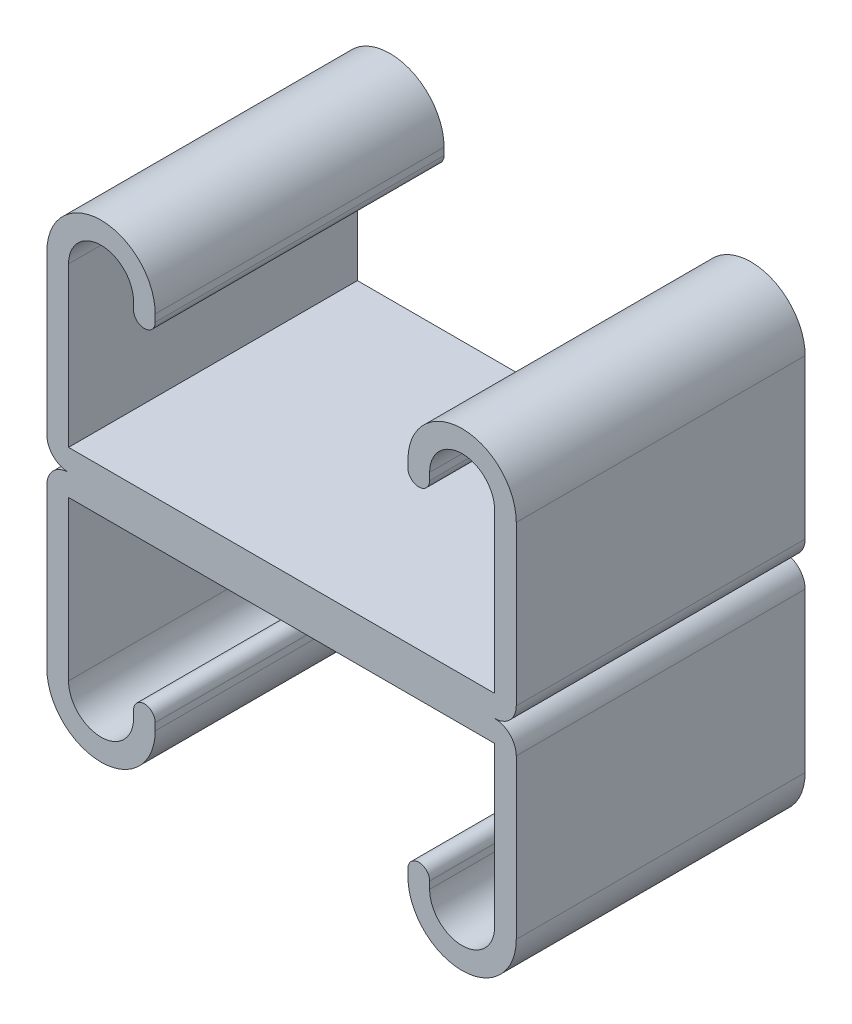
ISO-10303-21;
HEADER;
FILE_DESCRIPTION(('STEP AP214'),'2;1');
FILE_NAME('part.step','',(''),(''),'','','');
FILE_SCHEMA(('AUTOMOTIVE_DESIGN { 1 0 10303 214 1 1 1 1 }'));
ENDSEC;
DATA;
#1=APPLICATION_CONTEXT('core data for automotive mechanical design processes');
#2=APPLICATION_PROTOCOL_DEFINITION('international standard','automotive_design',2000,#1);
#3=PRODUCT_CONTEXT('',#1,'mechanical');
#4=PRODUCT('Part','Part','',(#3));
#5=PRODUCT_RELATED_PRODUCT_CATEGORY('part','',(#4));
#6=PRODUCT_DEFINITION_FORMATION('','',#4);
#7=PRODUCT_DEFINITION_CONTEXT('part definition',#1,'design');
#8=PRODUCT_DEFINITION('design','',#6,#7);
#9=PRODUCT_DEFINITION_SHAPE('','',#8);
#10=(LENGTH_UNIT() NAMED_UNIT(*) SI_UNIT(.MILLI.,.METRE.));
#11=(NAMED_UNIT(*) PLANE_ANGLE_UNIT() SI_UNIT($,.RADIAN.));
#12=(NAMED_UNIT(*) SI_UNIT($,.STERADIAN.) SOLID_ANGLE_UNIT());
#13=UNCERTAINTY_MEASURE_WITH_UNIT(LENGTH_MEASURE(1.E-05),#10,'distance_accuracy_value','');
#14=(GEOMETRIC_REPRESENTATION_CONTEXT(3) GLOBAL_UNCERTAINTY_ASSIGNED_CONTEXT((#13)) GLOBAL_UNIT_ASSIGNED_CONTEXT((#10,
#11,#12)) REPRESENTATION_CONTEXT('',''));
#15=CARTESIAN_POINT('',(0.,0.,0.));
#16=DIRECTION('',(0.,0.,1.));
#17=DIRECTION('',(1.,0.,0.));
#18=AXIS2_PLACEMENT_3D('',#15,#16,#17);
#19=CARTESIAN_POINT('',(-15.875,15.875,12.7));
#20=DIRECTION('',(0.,0.,-1.));
#21=DIRECTION('',(-1.,0.,0.));
#22=AXIS2_PLACEMENT_3D('',#19,#20,#21);
#23=CYLINDRICAL_SURFACE('',#22,4.7625);
#24=CARTESIAN_POINT('',(-15.875,15.875,-12.7));
#25=DIRECTION('',(0.,0.,1.));
#26=DIRECTION('',(-1.,0.,0.));
#27=AXIS2_PLACEMENT_3D('',#24,#25,#26);
#28=CIRCLE('',#27,4.7625);
#29=CARTESIAN_POINT('',(-11.1125,15.875,-12.7));
#30=VERTEX_POINT('',#29);
#31=CARTESIAN_POINT('',(-20.6375,15.875,-12.7));
#32=VERTEX_POINT('',#31);
#33=EDGE_CURVE('E207',#30,#32,#28,.T.);
#34=ORIENTED_EDGE('',*,*,#33,.T.);
#35=DIRECTION('',(0.,0.,-1.));
#36=VECTOR('',#35,1.);
#37=CARTESIAN_POINT('',(-20.6375,15.875,12.7));
#38=LINE('',#37,#36);
#39=CARTESIAN_POINT('',(-20.6375,15.875,12.7));
#40=VERTEX_POINT('',#39);
#41=EDGE_CURVE('E11',#40,#32,#38,.T.);
#42=ORIENTED_EDGE('',*,*,#41,.F.);
#43=CARTESIAN_POINT('',(-15.875,15.875,12.7));
#44=DIRECTION('',(0.,0.,1.));
#45=DIRECTION('',(-1.,0.,0.));
#46=AXIS2_PLACEMENT_3D('',#43,#44,#45);
#47=CIRCLE('',#46,4.7625);
#48=CARTESIAN_POINT('',(-11.1125,15.875,12.7));
#49=VERTEX_POINT('',#48);
#50=EDGE_CURVE('E253',#49,#40,#47,.T.);
#51=ORIENTED_EDGE('',*,*,#50,.F.);
#52=DIRECTION('',(0.,0.,-1.));
#53=VECTOR('',#52,1.);
#54=CARTESIAN_POINT('',(-11.1125,15.875,12.7));
#55=LINE('',#54,#53);
#56=EDGE_CURVE('E205',#49,#30,#55,.T.);
#57=ORIENTED_EDGE('',*,*,#56,.T.);
#58=EDGE_LOOP('',(#34,#42,#51,#57));
#59=FACE_BOUND('',#58,.T.);
#60=ADVANCED_FACE('F41',(#59),#23,.T.);
#61=CARTESIAN_POINT('',(-20.6375,15.875,12.7));
#62=DIRECTION('',(1.,0.,0.));
#63=DIRECTION('',(0.,1.,0.));
#64=AXIS2_PLACEMENT_3D('',#61,#62,#63);
#65=PLANE('',#64);
#66=DIRECTION('',(0.,-1.,0.));
#67=VECTOR('',#66,1.);
#68=CARTESIAN_POINT('',(-20.6375,15.875,-12.7));
#69=LINE('',#68,#67);
#70=CARTESIAN_POINT('',(-20.6375,1.905,-12.7));
#71=VERTEX_POINT('',#70);
#72=EDGE_CURVE('E208',#32,#71,#69,.T.);
#73=ORIENTED_EDGE('',*,*,#72,.T.);
#74=DIRECTION('',(0.,0.,-1.));
#75=VECTOR('',#74,1.);
#76=CARTESIAN_POINT('',(-20.6375,1.905,12.7));
#77=LINE('',#76,#75);
#78=CARTESIAN_POINT('',(-20.6375,1.905,12.7));
#79=VERTEX_POINT('',#78);
#80=EDGE_CURVE('E49',#79,#71,#77,.T.);
#81=ORIENTED_EDGE('',*,*,#80,.F.);
#82=DIRECTION('',(0.,-1.,0.));
#83=VECTOR('',#82,1.);
#84=CARTESIAN_POINT('',(-20.6375,15.875,12.7));
#85=LINE('',#84,#83);
#86=EDGE_CURVE('E128',#40,#79,#85,.T.);
#87=ORIENTED_EDGE('',*,*,#86,.F.);
#88=ORIENTED_EDGE('',*,*,#41,.T.);
#89=EDGE_LOOP('',(#73,#81,#87,#88));
#90=FACE_BOUND('',#89,.T.);
#91=ADVANCED_FACE('F512',(#90),#65,.F.);
#92=CARTESIAN_POINT('',(-18.7325,1.905,12.7));
#93=DIRECTION('',(0.,0.,-1.));
#94=DIRECTION('',(-1.,0.,0.));
#95=AXIS2_PLACEMENT_3D('',#92,#93,#94);
#96=CYLINDRICAL_SURFACE('',#95,1.905);
#97=CARTESIAN_POINT('',(-18.7325,1.905,-12.7));
#98=DIRECTION('',(0.,0.,1.));
#99=DIRECTION('',(-1.,0.,0.));
#100=AXIS2_PLACEMENT_3D('',#97,#98,#99);
#101=CIRCLE('',#100,1.905);
#102=CARTESIAN_POINT('',(-18.7325,0.,-12.7));
#103=VERTEX_POINT('',#102);
#104=EDGE_CURVE('E213',#71,#103,#101,.T.);
#105=ORIENTED_EDGE('',*,*,#104,.T.);
#106=DIRECTION('',(0.,0.,-1.));
#107=VECTOR('',#106,1.);
#108=CARTESIAN_POINT('',(-18.7325,0.,12.7));
#109=LINE('',#108,#107);
#110=CARTESIAN_POINT('',(-18.7325,0.,12.7));
#111=VERTEX_POINT('',#110);
#112=EDGE_CURVE('E304',#111,#103,#109,.T.);
#113=ORIENTED_EDGE('',*,*,#112,.F.);
#114=CARTESIAN_POINT('',(-18.7325,1.905,12.7));
#115=DIRECTION('',(0.,0.,1.));
#116=DIRECTION('',(-1.,0.,0.));
#117=AXIS2_PLACEMENT_3D('',#114,#115,#116);
#118=CIRCLE('',#117,1.905);
#119=EDGE_CURVE('E320',#79,#111,#118,.T.);
#120=ORIENTED_EDGE('',*,*,#119,.F.);
#121=ORIENTED_EDGE('',*,*,#80,.T.);
#122=EDGE_LOOP('',(#105,#113,#120,#121));
#123=FACE_BOUND('',#122,.T.);
#124=ADVANCED_FACE('F314',(#123),#96,.T.);
#125=CARTESIAN_POINT('',(18.7325,1.90500000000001,12.7));
#126=DIRECTION('',(0.,0.,-1.));
#127=DIRECTION('',(-1.,0.,0.));
#128=AXIS2_PLACEMENT_3D('',#125,#126,#127);
#129=CYLINDRICAL_SURFACE('',#128,1.905);
#130=CARTESIAN_POINT('',(18.7325,1.90500000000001,-12.7));
#131=DIRECTION('',(0.,0.,1.));
#132=DIRECTION('',(1.,0.,0.));
#133=AXIS2_PLACEMENT_3D('',#130,#131,#132);
#134=CIRCLE('',#133,1.905);
#135=CARTESIAN_POINT('',(18.7325,0.,-12.7));
#136=VERTEX_POINT('',#135);
#137=CARTESIAN_POINT('',(20.6375,1.90500000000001,-12.7));
#138=VERTEX_POINT('',#137);
#139=EDGE_CURVE('E220',#136,#138,#134,.T.);
#140=ORIENTED_EDGE('',*,*,#139,.T.);
#141=DIRECTION('',(0.,0.,-1.));
#142=VECTOR('',#141,1.);
#143=CARTESIAN_POINT('',(20.6375,1.90500000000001,12.7));
#144=LINE('',#143,#142);
#145=CARTESIAN_POINT('',(20.6375,1.90500000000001,12.7));
#146=VERTEX_POINT('',#145);
#147=EDGE_CURVE('E300',#146,#138,#144,.T.);
#148=ORIENTED_EDGE('',*,*,#147,.F.);
#149=CARTESIAN_POINT('',(18.7325,1.90500000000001,12.7));
#150=DIRECTION('',(0.,0.,1.));
#151=DIRECTION('',(1.,0.,0.));
#152=AXIS2_PLACEMENT_3D('',#149,#150,#151);
#153=CIRCLE('',#152,1.905);
#154=CARTESIAN_POINT('',(18.7325,0.,12.7));
#155=VERTEX_POINT('',#154);
#156=EDGE_CURVE('E413',#155,#146,#153,.T.);
#157=ORIENTED_EDGE('',*,*,#156,.F.);
#158=DIRECTION('',(0.,0.,-1.));
#159=VECTOR('',#158,1.);
#160=CARTESIAN_POINT('',(18.7325,0.,12.7));
#161=LINE('',#160,#159);
#162=EDGE_CURVE('E301',#155,#136,#161,.T.);
#163=ORIENTED_EDGE('',*,*,#162,.T.);
#164=EDGE_LOOP('',(#140,#148,#157,#163));
#165=FACE_BOUND('',#164,.T.);
#166=ADVANCED_FACE('F520',(#165),#129,.T.);
#167=CARTESIAN_POINT('',(20.6375,1.90500000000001,12.7));
#168=DIRECTION('',(-1.,0.,0.));
#169=DIRECTION('',(0.,0.,1.));
#170=AXIS2_PLACEMENT_3D('',#167,#168,#169);
#171=PLANE('',#170);
#172=DIRECTION('',(0.,1.,0.));
#173=VECTOR('',#172,1.);
#174=CARTESIAN_POINT('',(20.6375,1.90500000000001,-12.7));
#175=LINE('',#174,#173);
#176=CARTESIAN_POINT('',(20.6375,15.875,-12.7));
#177=VERTEX_POINT('',#176);
#178=EDGE_CURVE('E216',#138,#177,#175,.T.);
#179=ORIENTED_EDGE('',*,*,#178,.T.);
#180=DIRECTION('',(0.,0.,-1.));
#181=VECTOR('',#180,1.);
#182=CARTESIAN_POINT('',(20.6375,15.875,12.7));
#183=LINE('',#182,#181);
#184=CARTESIAN_POINT('',(20.6375,15.875,12.7));
#185=VERTEX_POINT('',#184);
#186=EDGE_CURVE('E291',#185,#177,#183,.T.);
#187=ORIENTED_EDGE('',*,*,#186,.F.);
#188=DIRECTION('',(0.,1.,0.));
#189=VECTOR('',#188,1.);
#190=CARTESIAN_POINT('',(20.6375,1.90500000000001,12.7));
#191=LINE('',#190,#189);
#192=EDGE_CURVE('E417',#146,#185,#191,.T.);
#193=ORIENTED_EDGE('',*,*,#192,.F.);
#194=ORIENTED_EDGE('',*,*,#147,.T.);
#195=EDGE_LOOP('',(#179,#187,#193,#194));
#196=FACE_BOUND('',#195,.T.);
#197=ADVANCED_FACE('F523',(#196),#171,.F.);
#198=CARTESIAN_POINT('',(15.875,15.875,12.7));
#199=DIRECTION('',(0.,0.,-1.));
#200=DIRECTION('',(-1.,0.,0.));
#201=AXIS2_PLACEMENT_3D('',#198,#199,#200);
#202=CYLINDRICAL_SURFACE('',#201,4.7625);
#203=CARTESIAN_POINT('',(15.875,15.875,-12.7));
#204=DIRECTION('',(0.,0.,1.));
#205=DIRECTION('',(1.,0.,0.));
#206=AXIS2_PLACEMENT_3D('',#203,#204,#205);
#207=CIRCLE('',#206,4.7625);
#208=CARTESIAN_POINT('',(11.1125,15.875,-12.7));
#209=VERTEX_POINT('',#208);
#210=EDGE_CURVE('E224',#177,#209,#207,.T.);
#211=ORIENTED_EDGE('',*,*,#210,.T.);
#212=DIRECTION('',(0.,0.,-1.));
#213=VECTOR('',#212,1.);
#214=CARTESIAN_POINT('',(11.1125,15.875,12.7));
#215=LINE('',#214,#213);
#216=CARTESIAN_POINT('',(11.1125,15.875,12.7));
#217=VERTEX_POINT('',#216);
#218=EDGE_CURVE('E286',#217,#209,#215,.T.);
#219=ORIENTED_EDGE('',*,*,#218,.F.);
#220=CARTESIAN_POINT('',(15.875,15.875,12.7));
#221=DIRECTION('',(0.,0.,1.));
#222=DIRECTION('',(1.,0.,0.));
#223=AXIS2_PLACEMENT_3D('',#220,#221,#222);
#224=CIRCLE('',#223,4.7625);
#225=EDGE_CURVE('E416',#185,#217,#224,.T.);
#226=ORIENTED_EDGE('',*,*,#225,.F.);
#227=ORIENTED_EDGE('',*,*,#186,.T.);
#228=EDGE_LOOP('',(#211,#219,#226,#227));
#229=FACE_BOUND('',#228,.T.);
#230=ADVANCED_FACE('F527',(#229),#202,.T.);
#231=CARTESIAN_POINT('',(11.1125,15.875,12.7));
#232=DIRECTION('',(1.,0.,0.));
#233=DIRECTION('',(0.,1.,0.));
#234=AXIS2_PLACEMENT_3D('',#231,#232,#233);
#235=PLANE('',#234);
#236=DIRECTION('',(0.,-1.,0.));
#237=VECTOR('',#236,1.);
#238=CARTESIAN_POINT('',(11.1125,15.875,-12.7));
#239=LINE('',#238,#237);
#240=CARTESIAN_POINT('',(11.1125,15.24,-12.7));
#241=VERTEX_POINT('',#240);
#242=EDGE_CURVE('E228',#209,#241,#239,.T.);
#243=ORIENTED_EDGE('',*,*,#242,.T.);
#244=DIRECTION('',(0.,0.,-1.));
#245=VECTOR('',#244,1.);
#246=CARTESIAN_POINT('',(11.1125,15.24,12.7));
#247=LINE('',#246,#245);
#248=CARTESIAN_POINT('',(11.1125,15.24,12.7));
#249=VERTEX_POINT('',#248);
#250=EDGE_CURVE('E281',#249,#241,#247,.T.);
#251=ORIENTED_EDGE('',*,*,#250,.F.);
#252=DIRECTION('',(0.,-1.,0.));
#253=VECTOR('',#252,1.);
#254=CARTESIAN_POINT('',(11.1125,15.875,12.7));
#255=LINE('',#254,#253);
#256=EDGE_CURVE('E422',#217,#249,#255,.T.);
#257=ORIENTED_EDGE('',*,*,#256,.F.);
#258=ORIENTED_EDGE('',*,*,#218,.T.);
#259=EDGE_LOOP('',(#243,#251,#257,#258));
#260=FACE_BOUND('',#259,.T.);
#261=ADVANCED_FACE('F528',(#260),#235,.F.);
#262=CARTESIAN_POINT('',(12.065,15.24,12.7));
#263=DIRECTION('',(0.,0.,-1.));
#264=DIRECTION('',(-1.,0.,0.));
#265=AXIS2_PLACEMENT_3D('',#262,#263,#264);
#266=CYLINDRICAL_SURFACE('',#265,0.952500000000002);
#267=CARTESIAN_POINT('',(12.065,15.24,-12.7));
#268=DIRECTION('',(0.,0.,1.));
#269=DIRECTION('',(1.,0.,0.));
#270=AXIS2_PLACEMENT_3D('',#267,#268,#269);
#271=CIRCLE('',#270,0.952500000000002);
#272=CARTESIAN_POINT('',(13.0175,15.24,-12.7));
#273=VERTEX_POINT('',#272);
#274=EDGE_CURVE('E230',#241,#273,#271,.T.);
#275=ORIENTED_EDGE('',*,*,#274,.T.);
#276=DIRECTION('',(0.,0.,-1.));
#277=VECTOR('',#276,1.);
#278=CARTESIAN_POINT('',(13.0175,15.24,12.7));
#279=LINE('',#278,#277);
#280=CARTESIAN_POINT('',(13.0175,15.24,12.7));
#281=VERTEX_POINT('',#280);
#282=EDGE_CURVE('E282',#281,#273,#279,.T.);
#283=ORIENTED_EDGE('',*,*,#282,.F.);
#284=CARTESIAN_POINT('',(12.065,15.24,12.7));
#285=DIRECTION('',(0.,0.,1.));
#286=DIRECTION('',(1.,0.,0.));
#287=AXIS2_PLACEMENT_3D('',#284,#285,#286);
#288=CIRCLE('',#287,0.952500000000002);
#289=EDGE_CURVE('E424',#249,#281,#288,.T.);
#290=ORIENTED_EDGE('',*,*,#289,.F.);
#291=ORIENTED_EDGE('',*,*,#250,.T.);
#292=EDGE_LOOP('',(#275,#283,#290,#291));
#293=FACE_BOUND('',#292,.T.);
#294=ADVANCED_FACE('F534',(#293),#266,.T.);
#295=CARTESIAN_POINT('',(13.0175,15.875,12.7));
#296=DIRECTION('',(-1.,0.,0.));
#297=DIRECTION('',(0.,-1.,0.));
#298=AXIS2_PLACEMENT_3D('',#295,#296,#297);
#299=PLANE('',#298);
#300=DIRECTION('',(0.,1.,0.));
#301=VECTOR('',#300,1.);
#302=CARTESIAN_POINT('',(13.0175,15.875,-12.7));
#303=LINE('',#302,#301);
#304=CARTESIAN_POINT('',(13.0175,15.875,-12.7));
#305=VERTEX_POINT('',#304);
#306=EDGE_CURVE('E235',#273,#305,#303,.T.);
#307=ORIENTED_EDGE('',*,*,#306,.T.);
#308=DIRECTION('',(0.,0.,-1.));
#309=VECTOR('',#308,1.);
#310=CARTESIAN_POINT('',(13.0175,15.875,12.7));
#311=LINE('',#310,#309);
#312=CARTESIAN_POINT('',(13.0175,15.875,12.7));
#313=VERTEX_POINT('',#312);
#314=EDGE_CURVE('E276',#313,#305,#311,.T.);
#315=ORIENTED_EDGE('',*,*,#314,.F.);
#316=DIRECTION('',(0.,1.,0.));
#317=VECTOR('',#316,1.);
#318=CARTESIAN_POINT('',(13.0175,15.875,12.7));
#319=LINE('',#318,#317);
#320=EDGE_CURVE('E426',#281,#313,#319,.T.);
#321=ORIENTED_EDGE('',*,*,#320,.F.);
#322=ORIENTED_EDGE('',*,*,#282,.T.);
#323=EDGE_LOOP('',(#307,#315,#321,#322));
#324=FACE_BOUND('',#323,.T.);
#325=ADVANCED_FACE('F540',(#324),#299,.F.);
#326=CARTESIAN_POINT('',(15.875,15.875,12.7));
#327=DIRECTION('',(0.,0.,-1.));
#328=DIRECTION('',(-1.,0.,0.));
#329=AXIS2_PLACEMENT_3D('',#326,#327,#328);
#330=CYLINDRICAL_SURFACE('',#329,2.8575);
#331=CARTESIAN_POINT('',(15.875,15.875,-12.7));
#332=DIRECTION('',(0.,0.,-1.));
#333=DIRECTION('',(1.,0.,0.));
#334=AXIS2_PLACEMENT_3D('',#331,#332,#333);
#335=CIRCLE('',#334,2.8575);
#336=CARTESIAN_POINT('',(18.7325,15.875,-12.7));
#337=VERTEX_POINT('',#336);
#338=EDGE_CURVE('E232',#305,#337,#335,.T.);
#339=ORIENTED_EDGE('',*,*,#338,.T.);
#340=DIRECTION('',(0.,0.,-1.));
#341=VECTOR('',#340,1.);
#342=CARTESIAN_POINT('',(18.7325,15.875,12.7));
#343=LINE('',#342,#341);
#344=CARTESIAN_POINT('',(18.7325,15.875,12.7));
#345=VERTEX_POINT('',#344);
#346=EDGE_CURVE('E271',#345,#337,#343,.T.);
#347=ORIENTED_EDGE('',*,*,#346,.F.);
#348=CARTESIAN_POINT('',(15.875,15.875,12.7));
#349=DIRECTION('',(0.,0.,-1.));
#350=DIRECTION('',(1.,0.,0.));
#351=AXIS2_PLACEMENT_3D('',#348,#349,#350);
#352=CIRCLE('',#351,2.8575);
#353=EDGE_CURVE('E431',#313,#345,#352,.T.);
#354=ORIENTED_EDGE('',*,*,#353,.F.);
#355=ORIENTED_EDGE('',*,*,#314,.T.);
#356=EDGE_LOOP('',(#339,#347,#354,#355));
#357=FACE_BOUND('',#356,.T.);
#358=ADVANCED_FACE('F545',(#357),#330,.F.);
#359=CARTESIAN_POINT('',(18.7325,1.905,12.7));
#360=DIRECTION('',(1.,0.,0.));
#361=DIRECTION('',(0.,1.,0.));
#362=AXIS2_PLACEMENT_3D('',#359,#360,#361);
#363=PLANE('',#362);
#364=DIRECTION('',(0.,-1.,0.));
#365=VECTOR('',#364,1.);
#366=CARTESIAN_POINT('',(18.7325,1.905,-12.7));
#367=LINE('',#366,#365);
#368=CARTESIAN_POINT('',(18.7325,1.905,-12.7));
#369=VERTEX_POINT('',#368);
#370=EDGE_CURVE('E238',#337,#369,#367,.T.);
#371=ORIENTED_EDGE('',*,*,#370,.T.);
#372=DIRECTION('',(0.,0.,-1.));
#373=VECTOR('',#372,1.);
#374=CARTESIAN_POINT('',(18.7325,1.905,12.7));
#375=LINE('',#374,#373);
#376=CARTESIAN_POINT('',(18.7325,1.905,12.7));
#377=VERTEX_POINT('',#376);
#378=EDGE_CURVE('E266',#377,#369,#375,.T.);
#379=ORIENTED_EDGE('',*,*,#378,.F.);
#380=DIRECTION('',(0.,-1.,0.));
#381=VECTOR('',#380,1.);
#382=CARTESIAN_POINT('',(18.7325,1.905,12.7));
#383=LINE('',#382,#381);
#384=EDGE_CURVE('E432',#345,#377,#383,.T.);
#385=ORIENTED_EDGE('',*,*,#384,.F.);
#386=ORIENTED_EDGE('',*,*,#346,.T.);
#387=EDGE_LOOP('',(#371,#379,#385,#386));
#388=FACE_BOUND('',#387,.T.);
#389=ADVANCED_FACE('F547',(#388),#363,.F.);
#390=CARTESIAN_POINT('',(-18.7325,1.905,12.7));
#391=DIRECTION('',(0.,-1.,0.));
#392=DIRECTION('',(1.,0.,0.));
#393=AXIS2_PLACEMENT_3D('',#390,#391,#392);
#394=PLANE('',#393);
#395=DIRECTION('',(-1.,0.,0.));
#396=VECTOR('',#395,1.);
#397=CARTESIAN_POINT('',(-18.7325,1.905,-12.7));
#398=LINE('',#397,#396);
#399=CARTESIAN_POINT('',(-18.7325,1.905,-12.7));
#400=VERTEX_POINT('',#399);
#401=EDGE_CURVE('E241',#369,#400,#398,.T.);
#402=ORIENTED_EDGE('',*,*,#401,.T.);
#403=DIRECTION('',(0.,0.,-1.));
#404=VECTOR('',#403,1.);
#405=CARTESIAN_POINT('',(-18.7325,1.905,12.7));
#406=LINE('',#405,#404);
#407=CARTESIAN_POINT('',(-18.7325,1.905,12.7));
#408=VERTEX_POINT('',#407);
#409=EDGE_CURVE('E261',#408,#400,#406,.T.);
#410=ORIENTED_EDGE('',*,*,#409,.F.);
#411=DIRECTION('',(-1.,0.,0.));
#412=VECTOR('',#411,1.);
#413=CARTESIAN_POINT('',(-18.7325,1.905,12.7));
#414=LINE('',#413,#412);
#415=EDGE_CURVE('E440',#377,#408,#414,.T.);
#416=ORIENTED_EDGE('',*,*,#415,.F.);
#417=ORIENTED_EDGE('',*,*,#378,.T.);
#418=EDGE_LOOP('',(#402,#410,#416,#417));
#419=FACE_BOUND('',#418,.T.);
#420=ADVANCED_FACE('F548',(#419),#394,.F.);
#421=CARTESIAN_POINT('',(-18.7325,15.875,12.7));
#422=DIRECTION('',(-1.,0.,0.));
#423=DIRECTION('',(0.,-1.,0.));
#424=AXIS2_PLACEMENT_3D('',#421,#422,#423);
#425=PLANE('',#424);
#426=DIRECTION('',(0.,1.,0.));
#427=VECTOR('',#426,1.);
#428=CARTESIAN_POINT('',(-18.7325,15.875,-12.7));
#429=LINE('',#428,#427);
#430=CARTESIAN_POINT('',(-18.7325,15.875,-12.7));
#431=VERTEX_POINT('',#430);
#432=EDGE_CURVE('E242',#400,#431,#429,.T.);
#433=ORIENTED_EDGE('',*,*,#432,.T.);
#434=DIRECTION('',(0.,0.,-1.));
#435=VECTOR('',#434,1.);
#436=CARTESIAN_POINT('',(-18.7325,15.875,12.7));
#437=LINE('',#436,#435);
#438=CARTESIAN_POINT('',(-18.7325,15.875,12.7));
#439=VERTEX_POINT('',#438);
#440=EDGE_CURVE('E262',#439,#431,#437,.T.);
#441=ORIENTED_EDGE('',*,*,#440,.F.);
#442=DIRECTION('',(0.,1.,0.));
#443=VECTOR('',#442,1.);
#444=CARTESIAN_POINT('',(-18.7325,15.875,12.7));
#445=LINE('',#444,#443);
#446=EDGE_CURVE('E439',#408,#439,#445,.T.);
#447=ORIENTED_EDGE('',*,*,#446,.F.);
#448=ORIENTED_EDGE('',*,*,#409,.T.);
#449=EDGE_LOOP('',(#433,#441,#447,#448));
#450=FACE_BOUND('',#449,.T.);
#451=ADVANCED_FACE('F493',(#450),#425,.F.);
#452=CARTESIAN_POINT('',(-15.875,15.875,12.7));
#453=DIRECTION('',(0.,0.,-1.));
#454=DIRECTION('',(-1.,0.,0.));
#455=AXIS2_PLACEMENT_3D('',#452,#453,#454);
#456=CYLINDRICAL_SURFACE('',#455,2.8575);
#457=CARTESIAN_POINT('',(-15.875,15.875,-12.7));
#458=DIRECTION('',(0.,0.,-1.));
#459=DIRECTION('',(-1.,0.,0.));
#460=AXIS2_PLACEMENT_3D('',#457,#458,#459);
#461=CIRCLE('',#460,2.8575);
#462=CARTESIAN_POINT('',(-13.0175,15.875,-12.7));
#463=VERTEX_POINT('',#462);
#464=EDGE_CURVE('E250',#431,#463,#461,.T.);
#465=ORIENTED_EDGE('',*,*,#464,.T.);
#466=DIRECTION('',(0.,0.,-1.));
#467=VECTOR('',#466,1.);
#468=CARTESIAN_POINT('',(-13.0175,15.875,12.7));
#469=LINE('',#468,#467);
#470=CARTESIAN_POINT('',(-13.0175,15.875,12.7));
#471=VERTEX_POINT('',#470);
#472=EDGE_CURVE('E191',#471,#463,#469,.T.);
#473=ORIENTED_EDGE('',*,*,#472,.F.);
#474=CARTESIAN_POINT('',(-15.875,15.875,12.7));
#475=DIRECTION('',(0.,0.,-1.));
#476=DIRECTION('',(-1.,0.,0.));
#477=AXIS2_PLACEMENT_3D('',#474,#475,#476);
#478=CIRCLE('',#477,2.8575);
#479=EDGE_CURVE('E181',#439,#471,#478,.T.);
#480=ORIENTED_EDGE('',*,*,#479,.F.);
#481=ORIENTED_EDGE('',*,*,#440,.T.);
#482=EDGE_LOOP('',(#465,#473,#480,#481));
#483=FACE_BOUND('',#482,.T.);
#484=ADVANCED_FACE('F492',(#483),#456,.F.);
#485=CARTESIAN_POINT('',(-13.0175,15.875,12.7));
#486=DIRECTION('',(1.,0.,0.));
#487=DIRECTION('',(0.,1.,0.));
#488=AXIS2_PLACEMENT_3D('',#485,#486,#487);
#489=PLANE('',#488);
#490=DIRECTION('',(0.,-1.,0.));
#491=VECTOR('',#490,1.);
#492=CARTESIAN_POINT('',(-13.0175,15.875,-12.7));
#493=LINE('',#492,#491);
#494=CARTESIAN_POINT('',(-13.0175,15.24,-12.7));
#495=VERTEX_POINT('',#494);
#496=EDGE_CURVE('E188',#463,#495,#493,.T.);
#497=ORIENTED_EDGE('',*,*,#496,.T.);
#498=DIRECTION('',(0.,0.,-1.));
#499=VECTOR('',#498,1.);
#500=CARTESIAN_POINT('',(-13.0175,15.24,12.7));
#501=LINE('',#500,#499);
#502=CARTESIAN_POINT('',(-13.0175,15.24,12.7));
#503=VERTEX_POINT('',#502);
#504=EDGE_CURVE('E190',#503,#495,#501,.T.);
#505=ORIENTED_EDGE('',*,*,#504,.F.);
#506=DIRECTION('',(0.,-1.,0.));
#507=VECTOR('',#506,1.);
#508=CARTESIAN_POINT('',(-13.0175,15.875,12.7));
#509=LINE('',#508,#507);
#510=EDGE_CURVE('E174',#471,#503,#509,.T.);
#511=ORIENTED_EDGE('',*,*,#510,.F.);
#512=ORIENTED_EDGE('',*,*,#472,.T.);
#513=EDGE_LOOP('',(#497,#505,#511,#512));
#514=FACE_BOUND('',#513,.T.);
#515=ADVANCED_FACE('F189',(#514),#489,.F.);
#516=CARTESIAN_POINT('',(-12.065,15.24,12.7));
#517=DIRECTION('',(0.,0.,-1.));
#518=DIRECTION('',(-1.,0.,0.));
#519=AXIS2_PLACEMENT_3D('',#516,#517,#518);
#520=CYLINDRICAL_SURFACE('',#519,0.952500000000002);
#521=CARTESIAN_POINT('',(-12.065,15.24,-12.7));
#522=DIRECTION('',(0.,0.,1.));
#523=DIRECTION('',(-1.,0.,0.));
#524=AXIS2_PLACEMENT_3D('',#521,#522,#523);
#525=CIRCLE('',#524,0.952500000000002);
#526=CARTESIAN_POINT('',(-11.1125,15.24,-12.7));
#527=VERTEX_POINT('',#526);
#528=EDGE_CURVE('E114',#495,#527,#525,.T.);
#529=ORIENTED_EDGE('',*,*,#528,.T.);
#530=DIRECTION('',(0.,0.,-1.));
#531=VECTOR('',#530,1.);
#532=CARTESIAN_POINT('',(-11.1125,15.24,12.7));
#533=LINE('',#532,#531);
#534=CARTESIAN_POINT('',(-11.1125,15.24,12.7));
#535=VERTEX_POINT('',#534);
#536=EDGE_CURVE('E195',#535,#527,#533,.T.);
#537=ORIENTED_EDGE('',*,*,#536,.F.);
#538=CARTESIAN_POINT('',(-12.065,15.24,12.7));
#539=DIRECTION('',(0.,0.,1.));
#540=DIRECTION('',(-1.,0.,0.));
#541=AXIS2_PLACEMENT_3D('',#538,#539,#540);
#542=CIRCLE('',#541,0.952500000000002);
#543=EDGE_CURVE('E177',#503,#535,#542,.T.);
#544=ORIENTED_EDGE('',*,*,#543,.F.);
#545=ORIENTED_EDGE('',*,*,#504,.T.);
#546=EDGE_LOOP('',(#529,#537,#544,#545));
#547=FACE_BOUND('',#546,.T.);
#548=ADVANCED_FACE('F192',(#547),#520,.T.);
#549=CARTESIAN_POINT('',(-11.1125,15.875,12.7));
#550=DIRECTION('',(-1.,0.,0.));
#551=DIRECTION('',(0.,-1.,0.));
#552=AXIS2_PLACEMENT_3D('',#549,#550,#551);
#553=PLANE('',#552);
#554=DIRECTION('',(0.,1.,0.));
#555=VECTOR('',#554,1.);
#556=CARTESIAN_POINT('',(-11.1125,15.875,-12.7));
#557=LINE('',#556,#555);
#558=EDGE_CURVE('E122',#527,#30,#557,.T.);
#559=ORIENTED_EDGE('',*,*,#558,.T.);
#560=ORIENTED_EDGE('',*,*,#56,.F.);
#561=DIRECTION('',(0.,1.,0.));
#562=VECTOR('',#561,1.);
#563=CARTESIAN_POINT('',(-11.1125,15.875,12.7));
#564=LINE('',#563,#562);
#565=EDGE_CURVE('E59',#535,#49,#564,.T.);
#566=ORIENTED_EDGE('',*,*,#565,.F.);
#567=ORIENTED_EDGE('',*,*,#536,.T.);
#568=EDGE_LOOP('',(#559,#560,#566,#567));
#569=FACE_BOUND('',#568,.T.);
#570=ADVANCED_FACE('F497',(#569),#553,.F.);
#571=CARTESIAN_POINT('',(-15.875,15.875,12.7));
#572=DIRECTION('',(0.,0.,-1.));
#573=DIRECTION('',(-1.,0.,0.));
#574=AXIS2_PLACEMENT_3D('',#571,#572,#573);
#575=PLANE('',#574);
#576=ORIENTED_EDGE('',*,*,#50,.T.);
#577=ORIENTED_EDGE('',*,*,#86,.T.);
#578=ORIENTED_EDGE('',*,*,#119,.T.);
#579=CARTESIAN_POINT('',(-18.7325,-1.905,12.7));
#580=DIRECTION('',(0.,0.,-1.));
#581=DIRECTION('',(-1.,0.,0.));
#582=AXIS2_PLACEMENT_3D('',#579,#580,#581);
#583=CIRCLE('',#582,1.905);
#584=CARTESIAN_POINT('',(-20.6375,-1.905,12.7));
#585=VERTEX_POINT('',#584);
#586=EDGE_CURVE('E913',#585,#111,#583,.T.);
#587=ORIENTED_EDGE('',*,*,#586,.F.);
#588=DIRECTION('',(0.,1.,0.));
#589=VECTOR('',#588,1.);
#590=CARTESIAN_POINT('',(-20.6375,-15.875,12.7));
#591=LINE('',#590,#589);
#592=CARTESIAN_POINT('',(-20.6375,-15.875,12.7));
#593=VERTEX_POINT('',#592);
#594=EDGE_CURVE('E346',#593,#585,#591,.T.);
#595=ORIENTED_EDGE('',*,*,#594,.F.);
#596=CARTESIAN_POINT('',(-15.875,-15.875,12.7));
#597=DIRECTION('',(0.,0.,-1.));
#598=DIRECTION('',(-1.,0.,0.));
#599=AXIS2_PLACEMENT_3D('',#596,#597,#598);
#600=CIRCLE('',#599,4.7625);
#601=CARTESIAN_POINT('',(-11.1125,-15.875,12.7));
#602=VERTEX_POINT('',#601);
#603=EDGE_CURVE('E340',#602,#593,#600,.T.);
#604=ORIENTED_EDGE('',*,*,#603,.F.);
#605=DIRECTION('',(0.,-1.,0.));
#606=VECTOR('',#605,1.);
#607=CARTESIAN_POINT('',(-11.1125,-15.875,12.7));
#608=LINE('',#607,#606);
#609=CARTESIAN_POINT('',(-11.1125,-15.24,12.7));
#610=VERTEX_POINT('',#609);
#611=EDGE_CURVE('E850',#610,#602,#608,.T.);
#612=ORIENTED_EDGE('',*,*,#611,.F.);
#613=CARTESIAN_POINT('',(-12.065,-15.24,12.7));
#614=DIRECTION('',(0.,0.,-1.));
#615=DIRECTION('',(-1.,0.,0.));
#616=AXIS2_PLACEMENT_3D('',#613,#614,#615);
#617=CIRCLE('',#616,0.952500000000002);
#618=CARTESIAN_POINT('',(-13.0175,-15.24,12.7));
#619=VERTEX_POINT('',#618);
#620=EDGE_CURVE('E857',#619,#610,#617,.T.);
#621=ORIENTED_EDGE('',*,*,#620,.F.);
#622=DIRECTION('',(0.,1.,0.));
#623=VECTOR('',#622,1.);
#624=CARTESIAN_POINT('',(-13.0175,-15.875,12.7));
#625=LINE('',#624,#623);
#626=CARTESIAN_POINT('',(-13.0175,-15.875,12.7));
#627=VERTEX_POINT('',#626);
#628=EDGE_CURVE('E861',#627,#619,#625,.T.);
#629=ORIENTED_EDGE('',*,*,#628,.F.);
#630=CARTESIAN_POINT('',(-15.875,-15.875,12.7));
#631=DIRECTION('',(0.,0.,1.));
#632=DIRECTION('',(-1.,0.,0.));
#633=AXIS2_PLACEMENT_3D('',#630,#631,#632);
#634=CIRCLE('',#633,2.8575);
#635=CARTESIAN_POINT('',(-18.7325,-15.875,12.7));
#636=VERTEX_POINT('',#635);
#637=EDGE_CURVE('E867',#636,#627,#634,.T.);
#638=ORIENTED_EDGE('',*,*,#637,.F.);
#639=DIRECTION('',(0.,-1.,0.));
#640=VECTOR('',#639,1.);
#641=CARTESIAN_POINT('',(-18.7325,-15.875,12.7));
#642=LINE('',#641,#640);
#643=CARTESIAN_POINT('',(-18.7325,-1.905,12.7));
#644=VERTEX_POINT('',#643);
#645=EDGE_CURVE('E874',#644,#636,#642,.T.);
#646=ORIENTED_EDGE('',*,*,#645,.F.);
#647=DIRECTION('',(-1.,0.,0.));
#648=VECTOR('',#647,1.);
#649=CARTESIAN_POINT('',(-18.7325,-1.905,12.7));
#650=LINE('',#649,#648);
#651=CARTESIAN_POINT('',(18.7325,-1.905,12.7));
#652=VERTEX_POINT('',#651);
#653=EDGE_CURVE('E877',#652,#644,#650,.T.);
#654=ORIENTED_EDGE('',*,*,#653,.F.);
#655=DIRECTION('',(0.,1.,0.));
#656=VECTOR('',#655,1.);
#657=CARTESIAN_POINT('',(18.7325,-1.905,12.7));
#658=LINE('',#657,#656);
#659=CARTESIAN_POINT('',(18.7325,-15.875,12.7));
#660=VERTEX_POINT('',#659);
#661=EDGE_CURVE('E883',#660,#652,#658,.T.);
#662=ORIENTED_EDGE('',*,*,#661,.F.);
#663=CARTESIAN_POINT('',(15.875,-15.875,12.7));
#664=DIRECTION('',(0.,0.,1.));
#665=DIRECTION('',(1.,0.,0.));
#666=AXIS2_PLACEMENT_3D('',#663,#664,#665);
#667=CIRCLE('',#666,2.8575);
#668=CARTESIAN_POINT('',(13.0175,-15.875,12.7));
#669=VERTEX_POINT('',#668);
#670=EDGE_CURVE('E882',#669,#660,#667,.T.);
#671=ORIENTED_EDGE('',*,*,#670,.F.);
#672=DIRECTION('',(0.,-1.,0.));
#673=VECTOR('',#672,1.);
#674=CARTESIAN_POINT('',(13.0175,-15.875,12.7));
#675=LINE('',#674,#673);
#676=CARTESIAN_POINT('',(13.0175,-15.24,12.7));
#677=VERTEX_POINT('',#676);
#678=EDGE_CURVE('E887',#677,#669,#675,.T.);
#679=ORIENTED_EDGE('',*,*,#678,.F.);
#680=CARTESIAN_POINT('',(12.065,-15.24,12.7));
#681=DIRECTION('',(0.,0.,-1.));
#682=DIRECTION('',(1.,0.,0.));
#683=AXIS2_PLACEMENT_3D('',#680,#681,#682);
#684=CIRCLE('',#683,0.952500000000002);
#685=CARTESIAN_POINT('',(11.1125,-15.24,12.7));
#686=VERTEX_POINT('',#685);
#687=EDGE_CURVE('E893',#686,#677,#684,.T.);
#688=ORIENTED_EDGE('',*,*,#687,.F.);
#689=DIRECTION('',(0.,1.,0.));
#690=VECTOR('',#689,1.);
#691=CARTESIAN_POINT('',(11.1125,-15.875,12.7));
#692=LINE('',#691,#690);
#693=CARTESIAN_POINT('',(11.1125,-15.875,12.7));
#694=VERTEX_POINT('',#693);
#695=EDGE_CURVE('E900',#694,#686,#692,.T.);
#696=ORIENTED_EDGE('',*,*,#695,.F.);
#697=CARTESIAN_POINT('',(15.875,-15.875,12.7));
#698=DIRECTION('',(0.,0.,-1.));
#699=DIRECTION('',(1.,0.,0.));
#700=AXIS2_PLACEMENT_3D('',#697,#698,#699);
#701=CIRCLE('',#700,4.7625);
#702=CARTESIAN_POINT('',(20.6375,-15.875,12.7));
#703=VERTEX_POINT('',#702);
#704=EDGE_CURVE('E902',#703,#694,#701,.T.);
#705=ORIENTED_EDGE('',*,*,#704,.F.);
#706=DIRECTION('',(0.,-1.,0.));
#707=VECTOR('',#706,1.);
#708=CARTESIAN_POINT('',(20.6375,-1.90500000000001,12.7));
#709=LINE('',#708,#707);
#710=CARTESIAN_POINT('',(20.6375,-1.90500000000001,12.7));
#711=VERTEX_POINT('',#710);
#712=EDGE_CURVE('E903',#711,#703,#709,.T.);
#713=ORIENTED_EDGE('',*,*,#712,.F.);
#714=CARTESIAN_POINT('',(18.7325,-1.90500000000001,12.7));
#715=DIRECTION('',(0.,0.,-1.));
#716=DIRECTION('',(1.,0.,0.));
#717=AXIS2_PLACEMENT_3D('',#714,#715,#716);
#718=CIRCLE('',#717,1.905);
#719=EDGE_CURVE('E908',#155,#711,#718,.T.);
#720=ORIENTED_EDGE('',*,*,#719,.F.);
#721=ORIENTED_EDGE('',*,*,#156,.T.);
#722=ORIENTED_EDGE('',*,*,#192,.T.);
#723=ORIENTED_EDGE('',*,*,#225,.T.);
#724=ORIENTED_EDGE('',*,*,#256,.T.);
#725=ORIENTED_EDGE('',*,*,#289,.T.);
#726=ORIENTED_EDGE('',*,*,#320,.T.);
#727=ORIENTED_EDGE('',*,*,#353,.T.);
#728=ORIENTED_EDGE('',*,*,#384,.T.);
#729=ORIENTED_EDGE('',*,*,#415,.T.);
#730=ORIENTED_EDGE('',*,*,#446,.T.);
#731=ORIENTED_EDGE('',*,*,#479,.T.);
#732=ORIENTED_EDGE('',*,*,#510,.T.);
#733=ORIENTED_EDGE('',*,*,#543,.T.);
#734=ORIENTED_EDGE('',*,*,#565,.T.);
#735=EDGE_LOOP('',(#576,#577,#578,#587,#595,#604,#612,#621,#629,#638,#646,#654,#662,#671,#679,
#688,#696,#705,#713,#720,#721,#722,#723,#724,#725,#726,#727,#728,#729,#730,#731,#732,#733,#734));
#736=FACE_BOUND('',#735,.T.);
#737=ADVANCED_FACE('F180',(#736),#575,.F.);
#738=CARTESIAN_POINT('',(-15.875,15.875,-12.7));
#739=DIRECTION('',(0.,0.,-1.));
#740=DIRECTION('',(-1.,0.,0.));
#741=AXIS2_PLACEMENT_3D('',#738,#739,#740);
#742=PLANE('',#741);
#743=ORIENTED_EDGE('',*,*,#33,.F.);
#744=ORIENTED_EDGE('',*,*,#558,.F.);
#745=ORIENTED_EDGE('',*,*,#528,.F.);
#746=ORIENTED_EDGE('',*,*,#496,.F.);
#747=ORIENTED_EDGE('',*,*,#464,.F.);
#748=ORIENTED_EDGE('',*,*,#432,.F.);
#749=ORIENTED_EDGE('',*,*,#401,.F.);
#750=ORIENTED_EDGE('',*,*,#370,.F.);
#751=ORIENTED_EDGE('',*,*,#338,.F.);
#752=ORIENTED_EDGE('',*,*,#306,.F.);
#753=ORIENTED_EDGE('',*,*,#274,.F.);
#754=ORIENTED_EDGE('',*,*,#242,.F.);
#755=ORIENTED_EDGE('',*,*,#210,.F.);
#756=ORIENTED_EDGE('',*,*,#178,.F.);
#757=ORIENTED_EDGE('',*,*,#139,.F.);
#758=CARTESIAN_POINT('',(18.7325,-1.90500000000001,-12.7));
#759=DIRECTION('',(0.,0.,-1.));
#760=DIRECTION('',(1.,0.,0.));
#761=AXIS2_PLACEMENT_3D('',#758,#759,#760);
#762=CIRCLE('',#761,1.905);
#763=CARTESIAN_POINT('',(20.6375,-1.90500000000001,-12.7));
#764=VERTEX_POINT('',#763);
#765=EDGE_CURVE('E335',#136,#764,#762,.T.);
#766=ORIENTED_EDGE('',*,*,#765,.T.);
#767=DIRECTION('',(0.,-1.,0.));
#768=VECTOR('',#767,1.);
#769=CARTESIAN_POINT('',(20.6375,-1.90500000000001,-12.7));
#770=LINE('',#769,#768);
#771=CARTESIAN_POINT('',(20.6375,-15.875,-12.7));
#772=VERTEX_POINT('',#771);
#773=EDGE_CURVE('E344',#764,#772,#770,.T.);
#774=ORIENTED_EDGE('',*,*,#773,.T.);
#775=CARTESIAN_POINT('',(15.875,-15.875,-12.7));
#776=DIRECTION('',(0.,0.,-1.));
#777=DIRECTION('',(1.,0.,0.));
#778=AXIS2_PLACEMENT_3D('',#775,#776,#777);
#779=CIRCLE('',#778,4.7625);
#780=CARTESIAN_POINT('',(11.1125,-15.875,-12.7));
#781=VERTEX_POINT('',#780);
#782=EDGE_CURVE('E962',#772,#781,#779,.T.);
#783=ORIENTED_EDGE('',*,*,#782,.T.);
#784=DIRECTION('',(0.,1.,0.));
#785=VECTOR('',#784,1.);
#786=CARTESIAN_POINT('',(11.1125,-15.875,-12.7));
#787=LINE('',#786,#785);
#788=CARTESIAN_POINT('',(11.1125,-15.24,-12.7));
#789=VERTEX_POINT('',#788);
#790=EDGE_CURVE('E957',#781,#789,#787,.T.);
#791=ORIENTED_EDGE('',*,*,#790,.T.);
#792=CARTESIAN_POINT('',(12.065,-15.24,-12.7));
#793=DIRECTION('',(0.,0.,-1.));
#794=DIRECTION('',(1.,0.,0.));
#795=AXIS2_PLACEMENT_3D('',#792,#793,#794);
#796=CIRCLE('',#795,0.952500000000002);
#797=CARTESIAN_POINT('',(13.0175,-15.24,-12.7));
#798=VERTEX_POINT('',#797);
#799=EDGE_CURVE('E954',#789,#798,#796,.T.);
#800=ORIENTED_EDGE('',*,*,#799,.T.);
#801=DIRECTION('',(0.,-1.,0.));
#802=VECTOR('',#801,1.);
#803=CARTESIAN_POINT('',(13.0175,-15.875,-12.7));
#804=LINE('',#803,#802);
#805=CARTESIAN_POINT('',(13.0175,-15.875,-12.7));
#806=VERTEX_POINT('',#805);
#807=EDGE_CURVE('E951',#798,#806,#804,.T.);
#808=ORIENTED_EDGE('',*,*,#807,.T.);
#809=CARTESIAN_POINT('',(15.875,-15.875,-12.7));
#810=DIRECTION('',(0.,0.,1.));
#811=DIRECTION('',(1.,0.,0.));
#812=AXIS2_PLACEMENT_3D('',#809,#810,#811);
#813=CIRCLE('',#812,2.8575);
#814=CARTESIAN_POINT('',(18.7325,-15.875,-12.7));
#815=VERTEX_POINT('',#814);
#816=EDGE_CURVE('E950',#806,#815,#813,.T.);
#817=ORIENTED_EDGE('',*,*,#816,.T.);
#818=DIRECTION('',(0.,1.,0.));
#819=VECTOR('',#818,1.);
#820=CARTESIAN_POINT('',(18.7325,-1.905,-12.7));
#821=LINE('',#820,#819);
#822=CARTESIAN_POINT('',(18.7325,-1.905,-12.7));
#823=VERTEX_POINT('',#822);
#824=EDGE_CURVE('E941',#815,#823,#821,.T.);
#825=ORIENTED_EDGE('',*,*,#824,.T.);
#826=DIRECTION('',(-1.,0.,0.));
#827=VECTOR('',#826,1.);
#828=CARTESIAN_POINT('',(-18.7325,-1.905,-12.7));
#829=LINE('',#828,#827);
#830=CARTESIAN_POINT('',(-18.7325,-1.905,-12.7));
#831=VERTEX_POINT('',#830);
#832=EDGE_CURVE('E936',#823,#831,#829,.T.);
#833=ORIENTED_EDGE('',*,*,#832,.T.);
#834=DIRECTION('',(0.,-1.,0.));
#835=VECTOR('',#834,1.);
#836=CARTESIAN_POINT('',(-18.7325,-15.875,-12.7));
#837=LINE('',#836,#835);
#838=CARTESIAN_POINT('',(-18.7325,-15.875,-12.7));
#839=VERTEX_POINT('',#838);
#840=EDGE_CURVE('E931',#831,#839,#837,.T.);
#841=ORIENTED_EDGE('',*,*,#840,.T.);
#842=CARTESIAN_POINT('',(-15.875,-15.875,-12.7));
#843=DIRECTION('',(0.,0.,1.));
#844=DIRECTION('',(-1.,0.,0.));
#845=AXIS2_PLACEMENT_3D('',#842,#843,#844);
#846=CIRCLE('',#845,2.8575);
#847=CARTESIAN_POINT('',(-13.0175,-15.875,-12.7));
#848=VERTEX_POINT('',#847);
#849=EDGE_CURVE('E932',#839,#848,#846,.T.);
#850=ORIENTED_EDGE('',*,*,#849,.T.);
#851=DIRECTION('',(0.,1.,0.));
#852=VECTOR('',#851,1.);
#853=CARTESIAN_POINT('',(-13.0175,-15.875,-12.7));
#854=LINE('',#853,#852);
#855=CARTESIAN_POINT('',(-13.0175,-15.24,-12.7));
#856=VERTEX_POINT('',#855);
#857=EDGE_CURVE('E926',#848,#856,#854,.T.);
#858=ORIENTED_EDGE('',*,*,#857,.T.);
#859=CARTESIAN_POINT('',(-12.065,-15.24,-12.7));
#860=DIRECTION('',(0.,0.,-1.));
#861=DIRECTION('',(-1.,0.,0.));
#862=AXIS2_PLACEMENT_3D('',#859,#860,#861);
#863=CIRCLE('',#862,0.952500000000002);
#864=CARTESIAN_POINT('',(-11.1125,-15.24,-12.7));
#865=VERTEX_POINT('',#864);
#866=EDGE_CURVE('E924',#856,#865,#863,.T.);
#867=ORIENTED_EDGE('',*,*,#866,.T.);
#868=DIRECTION('',(0.,-1.,0.));
#869=VECTOR('',#868,1.);
#870=CARTESIAN_POINT('',(-11.1125,-15.875,-12.7));
#871=LINE('',#870,#869);
#872=CARTESIAN_POINT('',(-11.1125,-15.875,-12.7));
#873=VERTEX_POINT('',#872);
#874=EDGE_CURVE('E849',#865,#873,#871,.T.);
#875=ORIENTED_EDGE('',*,*,#874,.T.);
#876=CARTESIAN_POINT('',(-15.875,-15.875,-12.7));
#877=DIRECTION('',(0.,0.,-1.));
#878=DIRECTION('',(-1.,0.,0.));
#879=AXIS2_PLACEMENT_3D('',#876,#877,#878);
#880=CIRCLE('',#879,4.7625);
#881=CARTESIAN_POINT('',(-20.6375,-15.875,-12.7));
#882=VERTEX_POINT('',#881);
#883=EDGE_CURVE('E916',#873,#882,#880,.T.);
#884=ORIENTED_EDGE('',*,*,#883,.T.);
#885=DIRECTION('',(0.,1.,0.));
#886=VECTOR('',#885,1.);
#887=CARTESIAN_POINT('',(-20.6375,-15.875,-12.7));
#888=LINE('',#887,#886);
#889=CARTESIAN_POINT('',(-20.6375,-1.905,-12.7));
#890=VERTEX_POINT('',#889);
#891=EDGE_CURVE('E328',#882,#890,#888,.T.);
#892=ORIENTED_EDGE('',*,*,#891,.T.);
#893=CARTESIAN_POINT('',(-18.7325,-1.905,-12.7));
#894=DIRECTION('',(0.,0.,-1.));
#895=DIRECTION('',(-1.,0.,0.));
#896=AXIS2_PLACEMENT_3D('',#893,#894,#895);
#897=CIRCLE('',#896,1.905);
#898=EDGE_CURVE('E323',#890,#103,#897,.T.);
#899=ORIENTED_EDGE('',*,*,#898,.T.);
#900=ORIENTED_EDGE('',*,*,#104,.F.);
#901=ORIENTED_EDGE('',*,*,#72,.F.);
#902=EDGE_LOOP('',(#743,#744,#745,#746,#747,#748,#749,#750,#751,#752,#753,#754,#755,#756,#757,
#766,#774,#783,#791,#800,#808,#817,#825,#833,#841,#850,#858,#867,#875,#884,#892,#899,#900,#901));
#903=FACE_BOUND('',#902,.T.);
#904=ADVANCED_FACE('F324',(#903),#742,.T.);
#905=CARTESIAN_POINT('',(-15.875,-15.875,12.7));
#906=DIRECTION('',(0.,0.,-1.));
#907=DIRECTION('',(-1.,0.,0.));
#908=AXIS2_PLACEMENT_3D('',#905,#906,#907);
#909=CYLINDRICAL_SURFACE('',#908,4.7625);
#910=ORIENTED_EDGE('',*,*,#883,.F.);
#911=DIRECTION('',(0.,0.,-1.));
#912=VECTOR('',#911,1.);
#913=CARTESIAN_POINT('',(-11.1125,-15.875,12.7));
#914=LINE('',#913,#912);
#915=EDGE_CURVE('E214',#602,#873,#914,.T.);
#916=ORIENTED_EDGE('',*,*,#915,.F.);
#917=ORIENTED_EDGE('',*,*,#603,.T.);
#918=DIRECTION('',(0.,0.,-1.));
#919=VECTOR('',#918,1.);
#920=CARTESIAN_POINT('',(-20.6375,-15.875,12.7));
#921=LINE('',#920,#919);
#922=EDGE_CURVE('E342',#593,#882,#921,.T.);
#923=ORIENTED_EDGE('',*,*,#922,.T.);
#924=EDGE_LOOP('',(#910,#916,#917,#923));
#925=FACE_BOUND('',#924,.T.);
#926=ADVANCED_FACE('F592',(#925),#909,.T.);
#927=CARTESIAN_POINT('',(-11.1125,-15.875,12.7));
#928=DIRECTION('',(1.,0.,0.));
#929=DIRECTION('',(0.,1.,0.));
#930=AXIS2_PLACEMENT_3D('',#927,#928,#929);
#931=PLANE('',#930);
#932=ORIENTED_EDGE('',*,*,#874,.F.);
#933=DIRECTION('',(0.,0.,-1.));
#934=VECTOR('',#933,1.);
#935=CARTESIAN_POINT('',(-11.1125,-15.24,12.7));
#936=LINE('',#935,#934);
#937=EDGE_CURVE('E405',#610,#865,#936,.T.);
#938=ORIENTED_EDGE('',*,*,#937,.F.);
#939=ORIENTED_EDGE('',*,*,#611,.T.);
#940=ORIENTED_EDGE('',*,*,#915,.T.);
#941=EDGE_LOOP('',(#932,#938,#939,#940));
#942=FACE_BOUND('',#941,.T.);
#943=ADVANCED_FACE('F601',(#942),#931,.T.);
#944=CARTESIAN_POINT('',(-12.065,-15.24,12.7));
#945=DIRECTION('',(0.,0.,-1.));
#946=DIRECTION('',(-1.,0.,0.));
#947=AXIS2_PLACEMENT_3D('',#944,#945,#946);
#948=CYLINDRICAL_SURFACE('',#947,0.952500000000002);
#949=ORIENTED_EDGE('',*,*,#866,.F.);
#950=DIRECTION('',(0.,0.,-1.));
#951=VECTOR('',#950,1.);
#952=CARTESIAN_POINT('',(-13.0175,-15.24,12.7));
#953=LINE('',#952,#951);
#954=EDGE_CURVE('E399',#619,#856,#953,.T.);
#955=ORIENTED_EDGE('',*,*,#954,.F.);
#956=ORIENTED_EDGE('',*,*,#620,.T.);
#957=ORIENTED_EDGE('',*,*,#937,.T.);
#958=EDGE_LOOP('',(#949,#955,#956,#957));
#959=FACE_BOUND('',#958,.T.);
#960=ADVANCED_FACE('F615',(#959),#948,.T.);
#961=CARTESIAN_POINT('',(-13.0175,-15.875,12.7));
#962=DIRECTION('',(-1.,0.,0.));
#963=DIRECTION('',(0.,-1.,0.));
#964=AXIS2_PLACEMENT_3D('',#961,#962,#963);
#965=PLANE('',#964);
#966=ORIENTED_EDGE('',*,*,#857,.F.);
#967=DIRECTION('',(0.,0.,-1.));
#968=VECTOR('',#967,1.);
#969=CARTESIAN_POINT('',(-13.0175,-15.875,12.7));
#970=LINE('',#969,#968);
#971=EDGE_CURVE('E394',#627,#848,#970,.T.);
#972=ORIENTED_EDGE('',*,*,#971,.F.);
#973=ORIENTED_EDGE('',*,*,#628,.T.);
#974=ORIENTED_EDGE('',*,*,#954,.T.);
#975=EDGE_LOOP('',(#966,#972,#973,#974));
#976=FACE_BOUND('',#975,.T.);
#977=ADVANCED_FACE('F625',(#976),#965,.T.);
#978=CARTESIAN_POINT('',(-15.875,-15.875,12.7));
#979=DIRECTION('',(0.,0.,-1.));
#980=DIRECTION('',(-1.,0.,0.));
#981=AXIS2_PLACEMENT_3D('',#978,#979,#980);
#982=CYLINDRICAL_SURFACE('',#981,2.8575);
#983=ORIENTED_EDGE('',*,*,#849,.F.);
#984=DIRECTION('',(0.,0.,-1.));
#985=VECTOR('',#984,1.);
#986=CARTESIAN_POINT('',(-18.7325,-15.875,12.7));
#987=LINE('',#986,#985);
#988=EDGE_CURVE('E387',#636,#839,#987,.T.);
#989=ORIENTED_EDGE('',*,*,#988,.F.);
#990=ORIENTED_EDGE('',*,*,#637,.T.);
#991=ORIENTED_EDGE('',*,*,#971,.T.);
#992=EDGE_LOOP('',(#983,#989,#990,#991));
#993=FACE_BOUND('',#992,.T.);
#994=ADVANCED_FACE('F635',(#993),#982,.F.);
#995=CARTESIAN_POINT('',(-18.7325,-15.875,12.7));
#996=DIRECTION('',(1.,0.,0.));
#997=DIRECTION('',(0.,1.,0.));
#998=AXIS2_PLACEMENT_3D('',#995,#996,#997);
#999=PLANE('',#998);
#1000=ORIENTED_EDGE('',*,*,#840,.F.);
#1001=DIRECTION('',(0.,0.,-1.));
#1002=VECTOR('',#1001,1.);
#1003=CARTESIAN_POINT('',(-18.7325,-1.905,12.7));
#1004=LINE('',#1003,#1002);
#1005=EDGE_CURVE('E389',#644,#831,#1004,.T.);
#1006=ORIENTED_EDGE('',*,*,#1005,.F.);
#1007=ORIENTED_EDGE('',*,*,#645,.T.);
#1008=ORIENTED_EDGE('',*,*,#988,.T.);
#1009=EDGE_LOOP('',(#1000,#1006,#1007,#1008));
#1010=FACE_BOUND('',#1009,.T.);
#1011=ADVANCED_FACE('F645',(#1010),#999,.T.);
#1012=CARTESIAN_POINT('',(-18.7325,-1.905,12.7));
#1013=DIRECTION('',(0.,-1.,0.));
#1014=DIRECTION('',(1.,0.,0.));
#1015=AXIS2_PLACEMENT_3D('',#1012,#1013,#1014);
#1016=PLANE('',#1015);
#1017=ORIENTED_EDGE('',*,*,#832,.F.);
#1018=DIRECTION('',(0.,0.,-1.));
#1019=VECTOR('',#1018,1.);
#1020=CARTESIAN_POINT('',(18.7325,-1.905,12.7));
#1021=LINE('',#1020,#1019);
#1022=EDGE_CURVE('E385',#652,#823,#1021,.T.);
#1023=ORIENTED_EDGE('',*,*,#1022,.F.);
#1024=ORIENTED_EDGE('',*,*,#653,.T.);
#1025=ORIENTED_EDGE('',*,*,#1005,.T.);
#1026=EDGE_LOOP('',(#1017,#1023,#1024,#1025));
#1027=FACE_BOUND('',#1026,.T.);
#1028=ADVANCED_FACE('F655',(#1027),#1016,.T.);
#1029=CARTESIAN_POINT('',(18.7325,-1.905,12.7));
#1030=DIRECTION('',(-1.,0.,0.));
#1031=DIRECTION('',(0.,-1.,0.));
#1032=AXIS2_PLACEMENT_3D('',#1029,#1030,#1031);
#1033=PLANE('',#1032);
#1034=ORIENTED_EDGE('',*,*,#824,.F.);
#1035=DIRECTION('',(0.,0.,-1.));
#1036=VECTOR('',#1035,1.);
#1037=CARTESIAN_POINT('',(18.7325,-15.875,12.7));
#1038=LINE('',#1037,#1036);
#1039=EDGE_CURVE('E377',#660,#815,#1038,.T.);
#1040=ORIENTED_EDGE('',*,*,#1039,.F.);
#1041=ORIENTED_EDGE('',*,*,#661,.T.);
#1042=ORIENTED_EDGE('',*,*,#1022,.T.);
#1043=EDGE_LOOP('',(#1034,#1040,#1041,#1042));
#1044=FACE_BOUND('',#1043,.T.);
#1045=ADVANCED_FACE('F665',(#1044),#1033,.T.);
#1046=CARTESIAN_POINT('',(15.875,-15.875,12.7));
#1047=DIRECTION('',(0.,0.,-1.));
#1048=DIRECTION('',(-1.,0.,0.));
#1049=AXIS2_PLACEMENT_3D('',#1046,#1047,#1048);
#1050=CYLINDRICAL_SURFACE('',#1049,2.8575);
#1051=ORIENTED_EDGE('',*,*,#816,.F.);
#1052=DIRECTION('',(0.,0.,-1.));
#1053=VECTOR('',#1052,1.);
#1054=CARTESIAN_POINT('',(13.0175,-15.875,12.7));
#1055=LINE('',#1054,#1053);
#1056=EDGE_CURVE('E372',#669,#806,#1055,.T.);
#1057=ORIENTED_EDGE('',*,*,#1056,.F.);
#1058=ORIENTED_EDGE('',*,*,#670,.T.);
#1059=ORIENTED_EDGE('',*,*,#1039,.T.);
#1060=EDGE_LOOP('',(#1051,#1057,#1058,#1059));
#1061=FACE_BOUND('',#1060,.T.);
#1062=ADVANCED_FACE('F675',(#1061),#1050,.F.);
#1063=CARTESIAN_POINT('',(13.0175,-15.875,12.7));
#1064=DIRECTION('',(1.,0.,0.));
#1065=DIRECTION('',(0.,1.,0.));
#1066=AXIS2_PLACEMENT_3D('',#1063,#1064,#1065);
#1067=PLANE('',#1066);
#1068=ORIENTED_EDGE('',*,*,#807,.F.);
#1069=DIRECTION('',(0.,0.,-1.));
#1070=VECTOR('',#1069,1.);
#1071=CARTESIAN_POINT('',(13.0175,-15.24,12.7));
#1072=LINE('',#1071,#1070);
#1073=EDGE_CURVE('E369',#677,#798,#1072,.T.);
#1074=ORIENTED_EDGE('',*,*,#1073,.F.);
#1075=ORIENTED_EDGE('',*,*,#678,.T.);
#1076=ORIENTED_EDGE('',*,*,#1056,.T.);
#1077=EDGE_LOOP('',(#1068,#1074,#1075,#1076));
#1078=FACE_BOUND('',#1077,.T.);
#1079=ADVANCED_FACE('F682',(#1078),#1067,.T.);
#1080=CARTESIAN_POINT('',(12.065,-15.24,12.7));
#1081=DIRECTION('',(0.,0.,-1.));
#1082=DIRECTION('',(-1.,0.,0.));
#1083=AXIS2_PLACEMENT_3D('',#1080,#1081,#1082);
#1084=CYLINDRICAL_SURFACE('',#1083,0.952500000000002);
#1085=ORIENTED_EDGE('',*,*,#799,.F.);
#1086=DIRECTION('',(0.,0.,-1.));
#1087=VECTOR('',#1086,1.);
#1088=CARTESIAN_POINT('',(11.1125,-15.24,12.7));
#1089=LINE('',#1088,#1087);
#1090=EDGE_CURVE('E366',#686,#789,#1089,.T.);
#1091=ORIENTED_EDGE('',*,*,#1090,.F.);
#1092=ORIENTED_EDGE('',*,*,#687,.T.);
#1093=ORIENTED_EDGE('',*,*,#1073,.T.);
#1094=EDGE_LOOP('',(#1085,#1091,#1092,#1093));
#1095=FACE_BOUND('',#1094,.T.);
#1096=ADVANCED_FACE('F695',(#1095),#1084,.T.);
#1097=CARTESIAN_POINT('',(11.1125,-15.875,12.7));
#1098=DIRECTION('',(-1.,0.,0.));
#1099=DIRECTION('',(0.,-1.,0.));
#1100=AXIS2_PLACEMENT_3D('',#1097,#1098,#1099);
#1101=PLANE('',#1100);
#1102=ORIENTED_EDGE('',*,*,#790,.F.);
#1103=DIRECTION('',(0.,0.,-1.));
#1104=VECTOR('',#1103,1.);
#1105=CARTESIAN_POINT('',(11.1125,-15.875,12.7));
#1106=LINE('',#1105,#1104);
#1107=EDGE_CURVE('E365',#694,#781,#1106,.T.);
#1108=ORIENTED_EDGE('',*,*,#1107,.F.);
#1109=ORIENTED_EDGE('',*,*,#695,.T.);
#1110=ORIENTED_EDGE('',*,*,#1090,.T.);
#1111=EDGE_LOOP('',(#1102,#1108,#1109,#1110));
#1112=FACE_BOUND('',#1111,.T.);
#1113=ADVANCED_FACE('F705',(#1112),#1101,.T.);
#1114=CARTESIAN_POINT('',(15.875,-15.875,12.7));
#1115=DIRECTION('',(0.,0.,-1.));
#1116=DIRECTION('',(-1.,0.,0.));
#1117=AXIS2_PLACEMENT_3D('',#1114,#1115,#1116);
#1118=CYLINDRICAL_SURFACE('',#1117,4.7625);
#1119=ORIENTED_EDGE('',*,*,#782,.F.);
#1120=DIRECTION('',(0.,0.,-1.));
#1121=VECTOR('',#1120,1.);
#1122=CARTESIAN_POINT('',(20.6375,-15.875,12.7));
#1123=LINE('',#1122,#1121);
#1124=EDGE_CURVE('E356',#703,#772,#1123,.T.);
#1125=ORIENTED_EDGE('',*,*,#1124,.F.);
#1126=ORIENTED_EDGE('',*,*,#704,.T.);
#1127=ORIENTED_EDGE('',*,*,#1107,.T.);
#1128=EDGE_LOOP('',(#1119,#1125,#1126,#1127));
#1129=FACE_BOUND('',#1128,.T.);
#1130=ADVANCED_FACE('F711',(#1129),#1118,.T.);
#1131=CARTESIAN_POINT('',(20.6375,-1.90500000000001,12.7));
#1132=DIRECTION('',(1.,0.,0.));
#1133=DIRECTION('',(0.,0.,-1.));
#1134=AXIS2_PLACEMENT_3D('',#1131,#1132,#1133);
#1135=PLANE('',#1134);
#1136=ORIENTED_EDGE('',*,*,#773,.F.);
#1137=DIRECTION('',(0.,0.,-1.));
#1138=VECTOR('',#1137,1.);
#1139=CARTESIAN_POINT('',(20.6375,-1.90500000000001,12.7));
#1140=LINE('',#1139,#1138);
#1141=EDGE_CURVE('E351',#711,#764,#1140,.T.);
#1142=ORIENTED_EDGE('',*,*,#1141,.F.);
#1143=ORIENTED_EDGE('',*,*,#712,.T.);
#1144=ORIENTED_EDGE('',*,*,#1124,.T.);
#1145=EDGE_LOOP('',(#1136,#1142,#1143,#1144));
#1146=FACE_BOUND('',#1145,.T.);
#1147=ADVANCED_FACE('F725',(#1146),#1135,.T.);
#1148=CARTESIAN_POINT('',(18.7325,-1.90500000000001,12.7));
#1149=DIRECTION('',(0.,0.,-1.));
#1150=DIRECTION('',(-1.,0.,0.));
#1151=AXIS2_PLACEMENT_3D('',#1148,#1149,#1150);
#1152=CYLINDRICAL_SURFACE('',#1151,1.905);
#1153=ORIENTED_EDGE('',*,*,#765,.F.);
#1154=ORIENTED_EDGE('',*,*,#162,.F.);
#1155=ORIENTED_EDGE('',*,*,#719,.T.);
#1156=ORIENTED_EDGE('',*,*,#1141,.T.);
#1157=EDGE_LOOP('',(#1153,#1154,#1155,#1156));
#1158=FACE_BOUND('',#1157,.T.);
#1159=ADVANCED_FACE('F731',(#1158),#1152,.T.);
#1160=CARTESIAN_POINT('',(-18.7325,-1.905,12.7));
#1161=DIRECTION('',(0.,0.,-1.));
#1162=DIRECTION('',(-1.,0.,0.));
#1163=AXIS2_PLACEMENT_3D('',#1160,#1161,#1162);
#1164=CYLINDRICAL_SURFACE('',#1163,1.905);
#1165=ORIENTED_EDGE('',*,*,#898,.F.);
#1166=DIRECTION('',(0.,0.,-1.));
#1167=VECTOR('',#1166,1.);
#1168=CARTESIAN_POINT('',(-20.6375,-1.905,12.7));
#1169=LINE('',#1168,#1167);
#1170=EDGE_CURVE('E349',#585,#890,#1169,.T.);
#1171=ORIENTED_EDGE('',*,*,#1170,.F.);
#1172=ORIENTED_EDGE('',*,*,#586,.T.);
#1173=ORIENTED_EDGE('',*,*,#112,.T.);
#1174=EDGE_LOOP('',(#1165,#1171,#1172,#1173));
#1175=FACE_BOUND('',#1174,.T.);
#1176=ADVANCED_FACE('F745',(#1175),#1164,.T.);
#1177=CARTESIAN_POINT('',(-20.6375,-15.875,12.7));
#1178=DIRECTION('',(-1.,0.,0.));
#1179=DIRECTION('',(0.,-1.,0.));
#1180=AXIS2_PLACEMENT_3D('',#1177,#1178,#1179);
#1181=PLANE('',#1180);
#1182=ORIENTED_EDGE('',*,*,#891,.F.);
#1183=ORIENTED_EDGE('',*,*,#922,.F.);
#1184=ORIENTED_EDGE('',*,*,#594,.T.);
#1185=ORIENTED_EDGE('',*,*,#1170,.T.);
#1186=EDGE_LOOP('',(#1182,#1183,#1184,#1185));
#1187=FACE_BOUND('',#1186,.T.);
#1188=ADVANCED_FACE('F755',(#1187),#1181,.T.);
#1189=CLOSED_SHELL('',(#60,#91,#124,#166,#197,#230,#261,#294,#325,#358,#389,#420,#451,#484,#515,
#548,#570,#737,#904,#926,#943,#960,#977,#994,#1011,#1028,#1045,#1062,#1079,#1096,#1113,#1130,
#1147,#1159,#1176,#1188));
#1190=MANIFOLD_SOLID_BREP('B2',#1189);
#1191=ADVANCED_BREP_SHAPE_REPRESENTATION('',(#18,#1190),#14);
#1192=SHAPE_DEFINITION_REPRESENTATION(#9,#1191);
ENDSEC;
END-ISO-10303-21;
